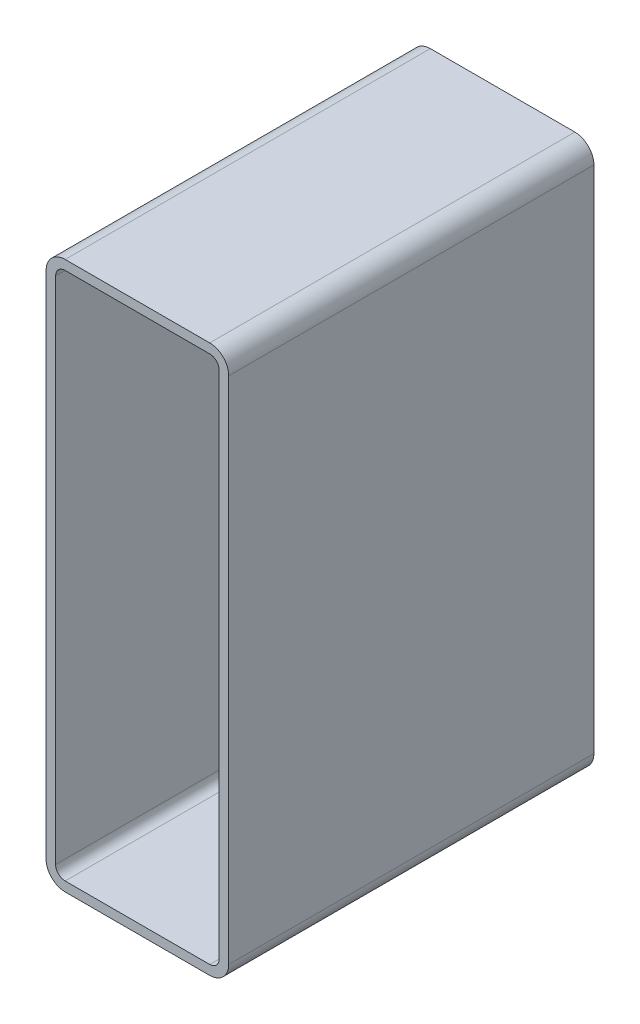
ISO-10303-21;
HEADER;
FILE_DESCRIPTION(('STEP AP214'),'2;1');
FILE_NAME('part.step','',(''),(''),'','','');
FILE_SCHEMA(('AUTOMOTIVE_DESIGN { 1 0 10303 214 1 1 1 1 }'));
ENDSEC;
DATA;
#1=APPLICATION_CONTEXT('core data for automotive mechanical design processes');
#2=APPLICATION_PROTOCOL_DEFINITION('international standard','automotive_design',2000,#1);
#3=PRODUCT_CONTEXT('',#1,'mechanical');
#4=PRODUCT('Part','Part','',(#3));
#5=PRODUCT_RELATED_PRODUCT_CATEGORY('part','',(#4));
#6=PRODUCT_DEFINITION_FORMATION('','',#4);
#7=PRODUCT_DEFINITION_CONTEXT('part definition',#1,'design');
#8=PRODUCT_DEFINITION('design','',#6,#7);
#9=PRODUCT_DEFINITION_SHAPE('','',#8);
#10=(LENGTH_UNIT() NAMED_UNIT(*) SI_UNIT(.MILLI.,.METRE.));
#11=(NAMED_UNIT(*) PLANE_ANGLE_UNIT() SI_UNIT($,.RADIAN.));
#12=(NAMED_UNIT(*) SI_UNIT($,.STERADIAN.) SOLID_ANGLE_UNIT());
#13=UNCERTAINTY_MEASURE_WITH_UNIT(LENGTH_MEASURE(1.E-05),#10,'distance_accuracy_value','');
#14=(GEOMETRIC_REPRESENTATION_CONTEXT(3) GLOBAL_UNCERTAINTY_ASSIGNED_CONTEXT((#13)) GLOBAL_UNIT_ASSIGNED_CONTEXT((#10,
#11,#12)) REPRESENTATION_CONTEXT('',''));
#15=CARTESIAN_POINT('',(0.,0.,0.));
#16=DIRECTION('',(0.,0.,1.));
#17=DIRECTION('',(1.,0.,0.));
#18=AXIS2_PLACEMENT_3D('',#15,#16,#17);
#19=CARTESIAN_POINT('',(15.9223013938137,443.062045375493,304.8));
#20=DIRECTION('',(0.,0.,1.));
#21=DIRECTION('',(1.,0.,0.));
#22=AXIS2_PLACEMENT_3D('',#19,#20,#21);
#23=PLANE('',#22);
#24=CARTESIAN_POINT('',(15.9223013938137,443.062045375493,304.8));
#25=DIRECTION('',(0.,0.,1.));
#26=DIRECTION('',(1.,0.,0.));
#27=AXIS2_PLACEMENT_3D('',#24,#25,#26);
#28=CIRCLE('',#27,15.875);
#29=CARTESIAN_POINT('',(15.9223013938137,458.937045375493,304.8));
#30=VERTEX_POINT('',#29);
#31=CARTESIAN_POINT('',(0.0473013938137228,443.062045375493,304.8));
#32=VERTEX_POINT('',#31);
#33=EDGE_CURVE('E211',#30,#32,#28,.T.);
#34=ORIENTED_EDGE('',*,*,#33,.T.);
#35=DIRECTION('',(0.,-1.,0.));
#36=VECTOR('',#35,1.);
#37=CARTESIAN_POINT('',(0.0473013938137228,443.062045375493,304.8));
#38=LINE('',#37,#36);
#39=CARTESIAN_POINT('',(0.0473013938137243,17.6120453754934,304.8));
#40=VERTEX_POINT('',#39);
#41=EDGE_CURVE('E214',#32,#40,#38,.T.);
#42=ORIENTED_EDGE('',*,*,#41,.T.);
#43=CARTESIAN_POINT('',(15.9223013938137,17.6120453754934,304.8));
#44=DIRECTION('',(0.,0.,1.));
#45=DIRECTION('',(1.,0.,0.));
#46=AXIS2_PLACEMENT_3D('',#43,#44,#45);
#47=CIRCLE('',#46,15.875);
#48=CARTESIAN_POINT('',(15.9223013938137,1.73704537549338,304.8));
#49=VERTEX_POINT('',#48);
#50=EDGE_CURVE('E217',#40,#49,#47,.T.);
#51=ORIENTED_EDGE('',*,*,#50,.T.);
#52=DIRECTION('',(1.,0.,0.));
#53=VECTOR('',#52,1.);
#54=CARTESIAN_POINT('',(15.9223013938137,1.73704537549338,304.8));
#55=LINE('',#54,#53);
#56=CARTESIAN_POINT('',(136.572301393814,1.73704537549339,304.8));
#57=VERTEX_POINT('',#56);
#58=EDGE_CURVE('E219',#49,#57,#55,.T.);
#59=ORIENTED_EDGE('',*,*,#58,.T.);
#60=CARTESIAN_POINT('',(136.572301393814,17.6120453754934,304.8));
#61=DIRECTION('',(0.,0.,1.));
#62=DIRECTION('',(1.,0.,0.));
#63=AXIS2_PLACEMENT_3D('',#60,#61,#62);
#64=CIRCLE('',#63,15.875);
#65=CARTESIAN_POINT('',(152.447301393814,17.6120453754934,304.8));
#66=VERTEX_POINT('',#65);
#67=EDGE_CURVE('E221',#57,#66,#64,.T.);
#68=ORIENTED_EDGE('',*,*,#67,.T.);
#69=DIRECTION('',(0.,1.,0.));
#70=VECTOR('',#69,1.);
#71=CARTESIAN_POINT('',(152.447301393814,17.6120453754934,304.8));
#72=LINE('',#71,#70);
#73=CARTESIAN_POINT('',(152.447301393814,443.062045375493,304.8));
#74=VERTEX_POINT('',#73);
#75=EDGE_CURVE('E223',#66,#74,#72,.T.);
#76=ORIENTED_EDGE('',*,*,#75,.T.);
#77=CARTESIAN_POINT('',(136.572301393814,443.062045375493,304.8));
#78=DIRECTION('',(0.,0.,1.));
#79=DIRECTION('',(1.,0.,0.));
#80=AXIS2_PLACEMENT_3D('',#77,#78,#79);
#81=CIRCLE('',#80,15.875);
#82=CARTESIAN_POINT('',(136.572301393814,458.937045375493,304.8));
#83=VERTEX_POINT('',#82);
#84=EDGE_CURVE('E225',#74,#83,#81,.T.);
#85=ORIENTED_EDGE('',*,*,#84,.T.);
#86=DIRECTION('',(-1.,0.,0.));
#87=VECTOR('',#86,1.);
#88=CARTESIAN_POINT('',(136.572301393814,458.937045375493,304.8));
#89=LINE('',#88,#87);
#90=EDGE_CURVE('E227',#83,#30,#89,.T.);
#91=ORIENTED_EDGE('',*,*,#90,.T.);
#92=EDGE_LOOP('',(#34,#42,#51,#59,#68,#76,#85,#91));
#93=FACE_BOUND('',#92,.T.);
#94=DIRECTION('',(0.,-1.,0.));
#95=VECTOR('',#94,1.);
#96=CARTESIAN_POINT('',(7.98480139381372,17.6120453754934,304.8));
#97=LINE('',#96,#95);
#98=CARTESIAN_POINT('',(7.98480139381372,443.062045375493,304.8));
#99=VERTEX_POINT('',#98);
#100=CARTESIAN_POINT('',(7.98480139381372,17.6120453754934,304.8));
#101=VERTEX_POINT('',#100);
#102=EDGE_CURVE('E154',#99,#101,#97,.T.);
#103=ORIENTED_EDGE('',*,*,#102,.F.);
#104=CARTESIAN_POINT('',(15.9223013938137,443.062045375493,304.8));
#105=DIRECTION('',(0.,0.,1.));
#106=DIRECTION('',(1.,0.,0.));
#107=AXIS2_PLACEMENT_3D('',#104,#105,#106);
#108=CIRCLE('',#107,7.93750000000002);
#109=CARTESIAN_POINT('',(15.9223013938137,450.999545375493,304.8));
#110=VERTEX_POINT('',#109);
#111=EDGE_CURVE('E146',#110,#99,#108,.T.);
#112=ORIENTED_EDGE('',*,*,#111,.F.);
#113=DIRECTION('',(-1.,0.,0.));
#114=VECTOR('',#113,1.);
#115=CARTESIAN_POINT('',(15.9223013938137,450.999545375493,304.8));
#116=LINE('',#115,#114);
#117=CARTESIAN_POINT('',(136.572301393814,450.999545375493,304.8));
#118=VERTEX_POINT('',#117);
#119=EDGE_CURVE('E179',#118,#110,#116,.T.);
#120=ORIENTED_EDGE('',*,*,#119,.F.);
#121=CARTESIAN_POINT('',(136.572301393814,443.062045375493,304.8));
#122=DIRECTION('',(0.,0.,1.));
#123=DIRECTION('',(1.,0.,0.));
#124=AXIS2_PLACEMENT_3D('',#121,#122,#123);
#125=CIRCLE('',#124,7.93750000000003);
#126=CARTESIAN_POINT('',(144.509801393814,443.062045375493,304.8));
#127=VERTEX_POINT('',#126);
#128=EDGE_CURVE('E177',#127,#118,#125,.T.);
#129=ORIENTED_EDGE('',*,*,#128,.F.);
#130=DIRECTION('',(0.,1.,0.));
#131=VECTOR('',#130,1.);
#132=CARTESIAN_POINT('',(144.509801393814,443.062045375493,304.8));
#133=LINE('',#132,#131);
#134=CARTESIAN_POINT('',(144.509801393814,17.6120453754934,304.8));
#135=VERTEX_POINT('',#134);
#136=EDGE_CURVE('E175',#135,#127,#133,.T.);
#137=ORIENTED_EDGE('',*,*,#136,.F.);
#138=CARTESIAN_POINT('',(136.572301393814,17.6120453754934,304.8));
#139=DIRECTION('',(0.,0.,1.));
#140=DIRECTION('',(1.,0.,0.));
#141=AXIS2_PLACEMENT_3D('',#138,#139,#140);
#142=CIRCLE('',#141,7.93750000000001);
#143=CARTESIAN_POINT('',(136.572301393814,9.67454537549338,304.8));
#144=VERTEX_POINT('',#143);
#145=EDGE_CURVE('E173',#144,#135,#142,.T.);
#146=ORIENTED_EDGE('',*,*,#145,.F.);
#147=DIRECTION('',(1.,0.,0.));
#148=VECTOR('',#147,1.);
#149=CARTESIAN_POINT('',(136.572301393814,9.67454537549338,304.8));
#150=LINE('',#149,#148);
#151=CARTESIAN_POINT('',(15.9223013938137,9.67454537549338,304.8));
#152=VERTEX_POINT('',#151);
#153=EDGE_CURVE('E169',#152,#144,#150,.T.);
#154=ORIENTED_EDGE('',*,*,#153,.F.);
#155=CARTESIAN_POINT('',(15.9223013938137,17.6120453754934,304.8));
#156=DIRECTION('',(0.,0.,1.));
#157=DIRECTION('',(1.,0.,0.));
#158=AXIS2_PLACEMENT_3D('',#155,#156,#157);
#159=CIRCLE('',#158,7.9375);
#160=EDGE_CURVE('E167',#101,#152,#159,.T.);
#161=ORIENTED_EDGE('',*,*,#160,.F.);
#162=EDGE_LOOP('',(#103,#112,#120,#129,#137,#146,#154,#161));
#163=FACE_BOUND('',#162,.T.);
#164=ADVANCED_FACE('F33',(#93,#163),#23,.T.);
#165=CARTESIAN_POINT('',(15.9223013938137,443.062045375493,0.));
#166=DIRECTION('',(0.,0.,1.));
#167=DIRECTION('',(1.,0.,0.));
#168=AXIS2_PLACEMENT_3D('',#165,#166,#167);
#169=PLANE('',#168);
#170=CARTESIAN_POINT('',(15.9223013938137,443.062045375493,0.));
#171=DIRECTION('',(0.,0.,1.));
#172=DIRECTION('',(1.,0.,0.));
#173=AXIS2_PLACEMENT_3D('',#170,#171,#172);
#174=CIRCLE('',#173,15.875);
#175=CARTESIAN_POINT('',(15.9223013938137,458.937045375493,0.));
#176=VERTEX_POINT('',#175);
#177=CARTESIAN_POINT('',(0.0473013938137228,443.062045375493,0.));
#178=VERTEX_POINT('',#177);
#179=EDGE_CURVE('E162',#176,#178,#174,.T.);
#180=ORIENTED_EDGE('',*,*,#179,.F.);
#181=DIRECTION('',(-1.,0.,0.));
#182=VECTOR('',#181,1.);
#183=CARTESIAN_POINT('',(136.572301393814,458.937045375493,0.));
#184=LINE('',#183,#182);
#185=CARTESIAN_POINT('',(136.572301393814,458.937045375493,0.));
#186=VERTEX_POINT('',#185);
#187=EDGE_CURVE('E215',#186,#176,#184,.T.);
#188=ORIENTED_EDGE('',*,*,#187,.F.);
#189=CARTESIAN_POINT('',(136.572301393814,443.062045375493,0.));
#190=DIRECTION('',(0.,0.,1.));
#191=DIRECTION('',(1.,0.,0.));
#192=AXIS2_PLACEMENT_3D('',#189,#190,#191);
#193=CIRCLE('',#192,15.875);
#194=CARTESIAN_POINT('',(152.447301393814,443.062045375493,0.));
#195=VERTEX_POINT('',#194);
#196=EDGE_CURVE('E242',#195,#186,#193,.T.);
#197=ORIENTED_EDGE('',*,*,#196,.F.);
#198=DIRECTION('',(0.,1.,0.));
#199=VECTOR('',#198,1.);
#200=CARTESIAN_POINT('',(152.447301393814,17.6120453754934,0.));
#201=LINE('',#200,#199);
#202=CARTESIAN_POINT('',(152.447301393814,17.6120453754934,0.));
#203=VERTEX_POINT('',#202);
#204=EDGE_CURVE('E240',#203,#195,#201,.T.);
#205=ORIENTED_EDGE('',*,*,#204,.F.);
#206=CARTESIAN_POINT('',(136.572301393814,17.6120453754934,0.));
#207=DIRECTION('',(0.,0.,1.));
#208=DIRECTION('',(1.,0.,0.));
#209=AXIS2_PLACEMENT_3D('',#206,#207,#208);
#210=CIRCLE('',#209,15.875);
#211=CARTESIAN_POINT('',(136.572301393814,1.73704537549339,0.));
#212=VERTEX_POINT('',#211);
#213=EDGE_CURVE('E238',#212,#203,#210,.T.);
#214=ORIENTED_EDGE('',*,*,#213,.F.);
#215=DIRECTION('',(1.,0.,0.));
#216=VECTOR('',#215,1.);
#217=CARTESIAN_POINT('',(15.9223013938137,1.73704537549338,0.));
#218=LINE('',#217,#216);
#219=CARTESIAN_POINT('',(15.9223013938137,1.73704537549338,0.));
#220=VERTEX_POINT('',#219);
#221=EDGE_CURVE('E236',#220,#212,#218,.T.);
#222=ORIENTED_EDGE('',*,*,#221,.F.);
#223=CARTESIAN_POINT('',(15.9223013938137,17.6120453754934,0.));
#224=DIRECTION('',(0.,0.,1.));
#225=DIRECTION('',(1.,0.,0.));
#226=AXIS2_PLACEMENT_3D('',#223,#224,#225);
#227=CIRCLE('',#226,15.875);
#228=CARTESIAN_POINT('',(0.0473013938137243,17.6120453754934,0.));
#229=VERTEX_POINT('',#228);
#230=EDGE_CURVE('E234',#229,#220,#227,.T.);
#231=ORIENTED_EDGE('',*,*,#230,.F.);
#232=DIRECTION('',(0.,-1.,0.));
#233=VECTOR('',#232,1.);
#234=CARTESIAN_POINT('',(0.0473013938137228,443.062045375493,0.));
#235=LINE('',#234,#233);
#236=EDGE_CURVE('E232',#178,#229,#235,.T.);
#237=ORIENTED_EDGE('',*,*,#236,.F.);
#238=EDGE_LOOP('',(#180,#188,#197,#205,#214,#222,#231,#237));
#239=FACE_BOUND('',#238,.T.);
#240=CARTESIAN_POINT('',(15.9223013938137,443.062045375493,0.));
#241=DIRECTION('',(0.,0.,1.));
#242=DIRECTION('',(1.,0.,0.));
#243=AXIS2_PLACEMENT_3D('',#240,#241,#242);
#244=CIRCLE('',#243,7.93750000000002);
#245=CARTESIAN_POINT('',(15.9223013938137,450.999545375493,0.));
#246=VERTEX_POINT('',#245);
#247=CARTESIAN_POINT('',(7.98480139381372,443.062045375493,0.));
#248=VERTEX_POINT('',#247);
#249=EDGE_CURVE('E56',#246,#248,#244,.T.);
#250=ORIENTED_EDGE('',*,*,#249,.T.);
#251=DIRECTION('',(0.,-1.,0.));
#252=VECTOR('',#251,1.);
#253=CARTESIAN_POINT('',(7.98480139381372,17.6120453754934,0.));
#254=LINE('',#253,#252);
#255=CARTESIAN_POINT('',(7.98480139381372,17.6120453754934,0.));
#256=VERTEX_POINT('',#255);
#257=EDGE_CURVE('E161',#248,#256,#254,.T.);
#258=ORIENTED_EDGE('',*,*,#257,.T.);
#259=CARTESIAN_POINT('',(15.9223013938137,17.6120453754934,0.));
#260=DIRECTION('',(0.,0.,1.));
#261=DIRECTION('',(1.,0.,0.));
#262=AXIS2_PLACEMENT_3D('',#259,#260,#261);
#263=CIRCLE('',#262,7.9375);
#264=CARTESIAN_POINT('',(15.9223013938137,9.67454537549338,0.));
#265=VERTEX_POINT('',#264);
#266=EDGE_CURVE('E183',#256,#265,#263,.T.);
#267=ORIENTED_EDGE('',*,*,#266,.T.);
#268=DIRECTION('',(1.,0.,0.));
#269=VECTOR('',#268,1.);
#270=CARTESIAN_POINT('',(136.572301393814,9.67454537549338,0.));
#271=LINE('',#270,#269);
#272=CARTESIAN_POINT('',(136.572301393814,9.67454537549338,0.));
#273=VERTEX_POINT('',#272);
#274=EDGE_CURVE('E186',#265,#273,#271,.T.);
#275=ORIENTED_EDGE('',*,*,#274,.T.);
#276=CARTESIAN_POINT('',(136.572301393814,17.6120453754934,0.));
#277=DIRECTION('',(0.,0.,1.));
#278=DIRECTION('',(1.,0.,0.));
#279=AXIS2_PLACEMENT_3D('',#276,#277,#278);
#280=CIRCLE('',#279,7.93750000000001);
#281=CARTESIAN_POINT('',(144.509801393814,17.6120453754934,0.));
#282=VERTEX_POINT('',#281);
#283=EDGE_CURVE('E189',#273,#282,#280,.T.);
#284=ORIENTED_EDGE('',*,*,#283,.T.);
#285=DIRECTION('',(0.,1.,0.));
#286=VECTOR('',#285,1.);
#287=CARTESIAN_POINT('',(144.509801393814,443.062045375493,0.));
#288=LINE('',#287,#286);
#289=CARTESIAN_POINT('',(144.509801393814,443.062045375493,0.));
#290=VERTEX_POINT('',#289);
#291=EDGE_CURVE('E192',#282,#290,#288,.T.);
#292=ORIENTED_EDGE('',*,*,#291,.T.);
#293=CARTESIAN_POINT('',(136.572301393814,443.062045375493,0.));
#294=DIRECTION('',(0.,0.,1.));
#295=DIRECTION('',(1.,0.,0.));
#296=AXIS2_PLACEMENT_3D('',#293,#294,#295);
#297=CIRCLE('',#296,7.93750000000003);
#298=CARTESIAN_POINT('',(136.572301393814,450.999545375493,0.));
#299=VERTEX_POINT('',#298);
#300=EDGE_CURVE('E195',#290,#299,#297,.T.);
#301=ORIENTED_EDGE('',*,*,#300,.T.);
#302=DIRECTION('',(-1.,0.,0.));
#303=VECTOR('',#302,1.);
#304=CARTESIAN_POINT('',(15.9223013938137,450.999545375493,0.));
#305=LINE('',#304,#303);
#306=EDGE_CURVE('E155',#299,#246,#305,.T.);
#307=ORIENTED_EDGE('',*,*,#306,.T.);
#308=EDGE_LOOP('',(#250,#258,#267,#275,#284,#292,#301,#307));
#309=FACE_BOUND('',#308,.T.);
#310=ADVANCED_FACE('F272',(#239,#309),#169,.F.);
#311=CARTESIAN_POINT('',(15.9223013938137,443.062045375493,304.8));
#312=DIRECTION('',(0.,0.,-1.));
#313=DIRECTION('',(-1.,0.,0.));
#314=AXIS2_PLACEMENT_3D('',#311,#312,#313);
#315=CYLINDRICAL_SURFACE('',#314,15.875);
#316=ORIENTED_EDGE('',*,*,#179,.T.);
#317=DIRECTION('',(0.,0.,-1.));
#318=VECTOR('',#317,1.);
#319=CARTESIAN_POINT('',(0.0473013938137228,443.062045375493,304.8));
#320=LINE('',#319,#318);
#321=EDGE_CURVE('E11',#32,#178,#320,.T.);
#322=ORIENTED_EDGE('',*,*,#321,.F.);
#323=ORIENTED_EDGE('',*,*,#33,.F.);
#324=DIRECTION('',(0.,0.,-1.));
#325=VECTOR('',#324,1.);
#326=CARTESIAN_POINT('',(15.9223013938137,458.937045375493,304.8));
#327=LINE('',#326,#325);
#328=EDGE_CURVE('E229',#30,#176,#327,.T.);
#329=ORIENTED_EDGE('',*,*,#328,.T.);
#330=EDGE_LOOP('',(#316,#322,#323,#329));
#331=FACE_BOUND('',#330,.T.);
#332=ADVANCED_FACE('F35',(#331),#315,.T.);
#333=CARTESIAN_POINT('',(0.0473013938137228,443.062045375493,304.8));
#334=DIRECTION('',(1.,0.,0.));
#335=DIRECTION('',(0.,0.,-1.));
#336=AXIS2_PLACEMENT_3D('',#333,#334,#335);
#337=PLANE('',#336);
#338=ORIENTED_EDGE('',*,*,#236,.T.);
#339=DIRECTION('',(0.,0.,-1.));
#340=VECTOR('',#339,1.);
#341=CARTESIAN_POINT('',(0.0473013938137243,17.6120453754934,304.8));
#342=LINE('',#341,#340);
#343=EDGE_CURVE('E41',#40,#229,#342,.T.);
#344=ORIENTED_EDGE('',*,*,#343,.F.);
#345=ORIENTED_EDGE('',*,*,#41,.F.);
#346=ORIENTED_EDGE('',*,*,#321,.T.);
#347=EDGE_LOOP('',(#338,#344,#345,#346));
#348=FACE_BOUND('',#347,.T.);
#349=ADVANCED_FACE('F289',(#348),#337,.F.);
#350=CARTESIAN_POINT('',(15.9223013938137,17.6120453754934,304.8));
#351=DIRECTION('',(0.,0.,-1.));
#352=DIRECTION('',(-1.,0.,0.));
#353=AXIS2_PLACEMENT_3D('',#350,#351,#352);
#354=CYLINDRICAL_SURFACE('',#353,15.875);
#355=ORIENTED_EDGE('',*,*,#230,.T.);
#356=DIRECTION('',(0.,0.,-1.));
#357=VECTOR('',#356,1.);
#358=CARTESIAN_POINT('',(15.9223013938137,1.73704537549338,304.8));
#359=LINE('',#358,#357);
#360=EDGE_CURVE('E259',#49,#220,#359,.T.);
#361=ORIENTED_EDGE('',*,*,#360,.F.);
#362=ORIENTED_EDGE('',*,*,#50,.F.);
#363=ORIENTED_EDGE('',*,*,#343,.T.);
#364=EDGE_LOOP('',(#355,#361,#362,#363));
#365=FACE_BOUND('',#364,.T.);
#366=ADVANCED_FACE('F266',(#365),#354,.T.);
#367=CARTESIAN_POINT('',(15.9223013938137,1.73704537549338,304.8));
#368=DIRECTION('',(0.,1.,0.));
#369=DIRECTION('',(0.,0.,1.));
#370=AXIS2_PLACEMENT_3D('',#367,#368,#369);
#371=PLANE('',#370);
#372=ORIENTED_EDGE('',*,*,#221,.T.);
#373=DIRECTION('',(0.,0.,-1.));
#374=VECTOR('',#373,1.);
#375=CARTESIAN_POINT('',(136.572301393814,1.73704537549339,304.8));
#376=LINE('',#375,#374);
#377=EDGE_CURVE('E256',#57,#212,#376,.T.);
#378=ORIENTED_EDGE('',*,*,#377,.F.);
#379=ORIENTED_EDGE('',*,*,#58,.F.);
#380=ORIENTED_EDGE('',*,*,#360,.T.);
#381=EDGE_LOOP('',(#372,#378,#379,#380));
#382=FACE_BOUND('',#381,.T.);
#383=ADVANCED_FACE('F278',(#382),#371,.F.);
#384=CARTESIAN_POINT('',(136.572301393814,17.6120453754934,304.8));
#385=DIRECTION('',(0.,0.,-1.));
#386=DIRECTION('',(-1.,0.,0.));
#387=AXIS2_PLACEMENT_3D('',#384,#385,#386);
#388=CYLINDRICAL_SURFACE('',#387,15.875);
#389=ORIENTED_EDGE('',*,*,#213,.T.);
#390=DIRECTION('',(0.,0.,-1.));
#391=VECTOR('',#390,1.);
#392=CARTESIAN_POINT('',(152.447301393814,17.6120453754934,304.8));
#393=LINE('',#392,#391);
#394=EDGE_CURVE('E253',#66,#203,#393,.T.);
#395=ORIENTED_EDGE('',*,*,#394,.F.);
#396=ORIENTED_EDGE('',*,*,#67,.F.);
#397=ORIENTED_EDGE('',*,*,#377,.T.);
#398=EDGE_LOOP('',(#389,#395,#396,#397));
#399=FACE_BOUND('',#398,.T.);
#400=ADVANCED_FACE('F282',(#399),#388,.T.);
#401=CARTESIAN_POINT('',(152.447301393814,17.6120453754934,304.8));
#402=DIRECTION('',(-1.,0.,0.));
#403=DIRECTION('',(0.,0.,1.));
#404=AXIS2_PLACEMENT_3D('',#401,#402,#403);
#405=PLANE('',#404);
#406=ORIENTED_EDGE('',*,*,#204,.T.);
#407=DIRECTION('',(0.,0.,-1.));
#408=VECTOR('',#407,1.);
#409=CARTESIAN_POINT('',(152.447301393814,443.062045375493,304.8));
#410=LINE('',#409,#408);
#411=EDGE_CURVE('E250',#74,#195,#410,.T.);
#412=ORIENTED_EDGE('',*,*,#411,.F.);
#413=ORIENTED_EDGE('',*,*,#75,.F.);
#414=ORIENTED_EDGE('',*,*,#394,.T.);
#415=EDGE_LOOP('',(#406,#412,#413,#414));
#416=FACE_BOUND('',#415,.T.);
#417=ADVANCED_FACE('F302',(#416),#405,.F.);
#418=CARTESIAN_POINT('',(136.572301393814,443.062045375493,304.8));
#419=DIRECTION('',(0.,0.,-1.));
#420=DIRECTION('',(-1.,0.,0.));
#421=AXIS2_PLACEMENT_3D('',#418,#419,#420);
#422=CYLINDRICAL_SURFACE('',#421,15.875);
#423=ORIENTED_EDGE('',*,*,#196,.T.);
#424=DIRECTION('',(0.,0.,-1.));
#425=VECTOR('',#424,1.);
#426=CARTESIAN_POINT('',(136.572301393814,458.937045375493,304.8));
#427=LINE('',#426,#425);
#428=EDGE_CURVE('E247',#83,#186,#427,.T.);
#429=ORIENTED_EDGE('',*,*,#428,.F.);
#430=ORIENTED_EDGE('',*,*,#84,.F.);
#431=ORIENTED_EDGE('',*,*,#411,.T.);
#432=EDGE_LOOP('',(#423,#429,#430,#431));
#433=FACE_BOUND('',#432,.T.);
#434=ADVANCED_FACE('F300',(#433),#422,.T.);
#435=CARTESIAN_POINT('',(136.572301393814,458.937045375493,304.8));
#436=DIRECTION('',(0.,-1.,0.));
#437=DIRECTION('',(0.,0.,-1.));
#438=AXIS2_PLACEMENT_3D('',#435,#436,#437);
#439=PLANE('',#438);
#440=ORIENTED_EDGE('',*,*,#187,.T.);
#441=ORIENTED_EDGE('',*,*,#328,.F.);
#442=ORIENTED_EDGE('',*,*,#90,.F.);
#443=ORIENTED_EDGE('',*,*,#428,.T.);
#444=EDGE_LOOP('',(#440,#441,#442,#443));
#445=FACE_BOUND('',#444,.T.);
#446=ADVANCED_FACE('F295',(#445),#439,.F.);
#447=CARTESIAN_POINT('',(15.9223013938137,443.062045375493,304.8));
#448=DIRECTION('',(0.,0.,-1.));
#449=DIRECTION('',(-1.,0.,0.));
#450=AXIS2_PLACEMENT_3D('',#447,#448,#449);
#451=CYLINDRICAL_SURFACE('',#450,7.93750000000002);
#452=ORIENTED_EDGE('',*,*,#249,.F.);
#453=DIRECTION('',(0.,0.,-1.));
#454=VECTOR('',#453,1.);
#455=CARTESIAN_POINT('',(15.9223013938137,450.999545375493,304.8));
#456=LINE('',#455,#454);
#457=EDGE_CURVE('E150',#110,#246,#456,.T.);
#458=ORIENTED_EDGE('',*,*,#457,.F.);
#459=ORIENTED_EDGE('',*,*,#111,.T.);
#460=DIRECTION('',(0.,0.,-1.));
#461=VECTOR('',#460,1.);
#462=CARTESIAN_POINT('',(7.98480139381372,443.062045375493,304.8));
#463=LINE('',#462,#461);
#464=EDGE_CURVE('E149',#99,#248,#463,.T.);
#465=ORIENTED_EDGE('',*,*,#464,.T.);
#466=EDGE_LOOP('',(#452,#458,#459,#465));
#467=FACE_BOUND('',#466,.T.);
#468=ADVANCED_FACE('F148',(#467),#451,.F.);
#469=CARTESIAN_POINT('',(7.98480139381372,17.6120453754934,304.8));
#470=DIRECTION('',(1.,0.,0.));
#471=DIRECTION('',(0.,0.,-1.));
#472=AXIS2_PLACEMENT_3D('',#469,#470,#471);
#473=PLANE('',#472);
#474=ORIENTED_EDGE('',*,*,#257,.F.);
#475=ORIENTED_EDGE('',*,*,#464,.F.);
#476=ORIENTED_EDGE('',*,*,#102,.T.);
#477=DIRECTION('',(0.,0.,-1.));
#478=VECTOR('',#477,1.);
#479=CARTESIAN_POINT('',(7.98480139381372,17.6120453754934,304.8));
#480=LINE('',#479,#478);
#481=EDGE_CURVE('E163',#101,#256,#480,.T.);
#482=ORIENTED_EDGE('',*,*,#481,.T.);
#483=EDGE_LOOP('',(#474,#475,#476,#482));
#484=FACE_BOUND('',#483,.T.);
#485=ADVANCED_FACE('F158',(#484),#473,.T.);
#486=CARTESIAN_POINT('',(15.9223013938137,17.6120453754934,304.8));
#487=DIRECTION('',(0.,0.,-1.));
#488=DIRECTION('',(-1.,0.,0.));
#489=AXIS2_PLACEMENT_3D('',#486,#487,#488);
#490=CYLINDRICAL_SURFACE('',#489,7.9375);
#491=ORIENTED_EDGE('',*,*,#266,.F.);
#492=ORIENTED_EDGE('',*,*,#481,.F.);
#493=ORIENTED_EDGE('',*,*,#160,.T.);
#494=DIRECTION('',(0.,0.,-1.));
#495=VECTOR('',#494,1.);
#496=CARTESIAN_POINT('',(15.9223013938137,9.67454537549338,304.8));
#497=LINE('',#496,#495);
#498=EDGE_CURVE('E208',#152,#265,#497,.T.);
#499=ORIENTED_EDGE('',*,*,#498,.T.);
#500=EDGE_LOOP('',(#491,#492,#493,#499));
#501=FACE_BOUND('',#500,.T.);
#502=ADVANCED_FACE('F327',(#501),#490,.F.);
#503=CARTESIAN_POINT('',(136.572301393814,9.67454537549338,304.8));
#504=DIRECTION('',(0.,1.,0.));
#505=DIRECTION('',(0.,0.,1.));
#506=AXIS2_PLACEMENT_3D('',#503,#504,#505);
#507=PLANE('',#506);
#508=ORIENTED_EDGE('',*,*,#274,.F.);
#509=ORIENTED_EDGE('',*,*,#498,.F.);
#510=ORIENTED_EDGE('',*,*,#153,.T.);
#511=DIRECTION('',(0.,0.,-1.));
#512=VECTOR('',#511,1.);
#513=CARTESIAN_POINT('',(136.572301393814,9.67454537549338,304.8));
#514=LINE('',#513,#512);
#515=EDGE_CURVE('E206',#144,#273,#514,.T.);
#516=ORIENTED_EDGE('',*,*,#515,.T.);
#517=EDGE_LOOP('',(#508,#509,#510,#516));
#518=FACE_BOUND('',#517,.T.);
#519=ADVANCED_FACE('F331',(#518),#507,.T.);
#520=CARTESIAN_POINT('',(136.572301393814,17.6120453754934,304.8));
#521=DIRECTION('',(0.,0.,-1.));
#522=DIRECTION('',(-1.,0.,0.));
#523=AXIS2_PLACEMENT_3D('',#520,#521,#522);
#524=CYLINDRICAL_SURFACE('',#523,7.93750000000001);
#525=ORIENTED_EDGE('',*,*,#283,.F.);
#526=ORIENTED_EDGE('',*,*,#515,.F.);
#527=ORIENTED_EDGE('',*,*,#145,.T.);
#528=DIRECTION('',(0.,0.,-1.));
#529=VECTOR('',#528,1.);
#530=CARTESIAN_POINT('',(144.509801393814,17.6120453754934,304.8));
#531=LINE('',#530,#529);
#532=EDGE_CURVE('E204',#135,#282,#531,.T.);
#533=ORIENTED_EDGE('',*,*,#532,.T.);
#534=EDGE_LOOP('',(#525,#526,#527,#533));
#535=FACE_BOUND('',#534,.T.);
#536=ADVANCED_FACE('F337',(#535),#524,.F.);
#537=CARTESIAN_POINT('',(144.509801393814,443.062045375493,304.8));
#538=DIRECTION('',(-1.,0.,0.));
#539=DIRECTION('',(0.,0.,1.));
#540=AXIS2_PLACEMENT_3D('',#537,#538,#539);
#541=PLANE('',#540);
#542=ORIENTED_EDGE('',*,*,#291,.F.);
#543=ORIENTED_EDGE('',*,*,#532,.F.);
#544=ORIENTED_EDGE('',*,*,#136,.T.);
#545=DIRECTION('',(0.,0.,-1.));
#546=VECTOR('',#545,1.);
#547=CARTESIAN_POINT('',(144.509801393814,443.062045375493,304.8));
#548=LINE('',#547,#546);
#549=EDGE_CURVE('E202',#127,#290,#548,.T.);
#550=ORIENTED_EDGE('',*,*,#549,.T.);
#551=EDGE_LOOP('',(#542,#543,#544,#550));
#552=FACE_BOUND('',#551,.T.);
#553=ADVANCED_FACE('F341',(#552),#541,.T.);
#554=CARTESIAN_POINT('',(136.572301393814,443.062045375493,304.8));
#555=DIRECTION('',(0.,0.,-1.));
#556=DIRECTION('',(-1.,0.,0.));
#557=AXIS2_PLACEMENT_3D('',#554,#555,#556);
#558=CYLINDRICAL_SURFACE('',#557,7.93750000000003);
#559=ORIENTED_EDGE('',*,*,#300,.F.);
#560=ORIENTED_EDGE('',*,*,#549,.F.);
#561=ORIENTED_EDGE('',*,*,#128,.T.);
#562=DIRECTION('',(0.,0.,-1.));
#563=VECTOR('',#562,1.);
#564=CARTESIAN_POINT('',(136.572301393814,450.999545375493,304.8));
#565=LINE('',#564,#563);
#566=EDGE_CURVE('E48',#118,#299,#565,.T.);
#567=ORIENTED_EDGE('',*,*,#566,.T.);
#568=EDGE_LOOP('',(#559,#560,#561,#567));
#569=FACE_BOUND('',#568,.T.);
#570=ADVANCED_FACE('F345',(#569),#558,.F.);
#571=CARTESIAN_POINT('',(15.9223013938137,450.999545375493,304.8));
#572=DIRECTION('',(0.,-1.,0.));
#573=DIRECTION('',(0.,0.,-1.));
#574=AXIS2_PLACEMENT_3D('',#571,#572,#573);
#575=PLANE('',#574);
#576=ORIENTED_EDGE('',*,*,#306,.F.);
#577=ORIENTED_EDGE('',*,*,#566,.F.);
#578=ORIENTED_EDGE('',*,*,#119,.T.);
#579=ORIENTED_EDGE('',*,*,#457,.T.);
#580=EDGE_LOOP('',(#576,#577,#578,#579));
#581=FACE_BOUND('',#580,.T.);
#582=ADVANCED_FACE('F349',(#581),#575,.T.);
#583=CLOSED_SHELL('',(#164,#310,#332,#349,#366,#383,#400,#417,#434,#446,#468,#485,#502,#519,
#536,#553,#570,#582));
#584=MANIFOLD_SOLID_BREP('B2',#583);
#585=ADVANCED_BREP_SHAPE_REPRESENTATION('',(#18,#584),#14);
#586=SHAPE_DEFINITION_REPRESENTATION(#9,#585);
ENDSEC;
END-ISO-10303-21;
